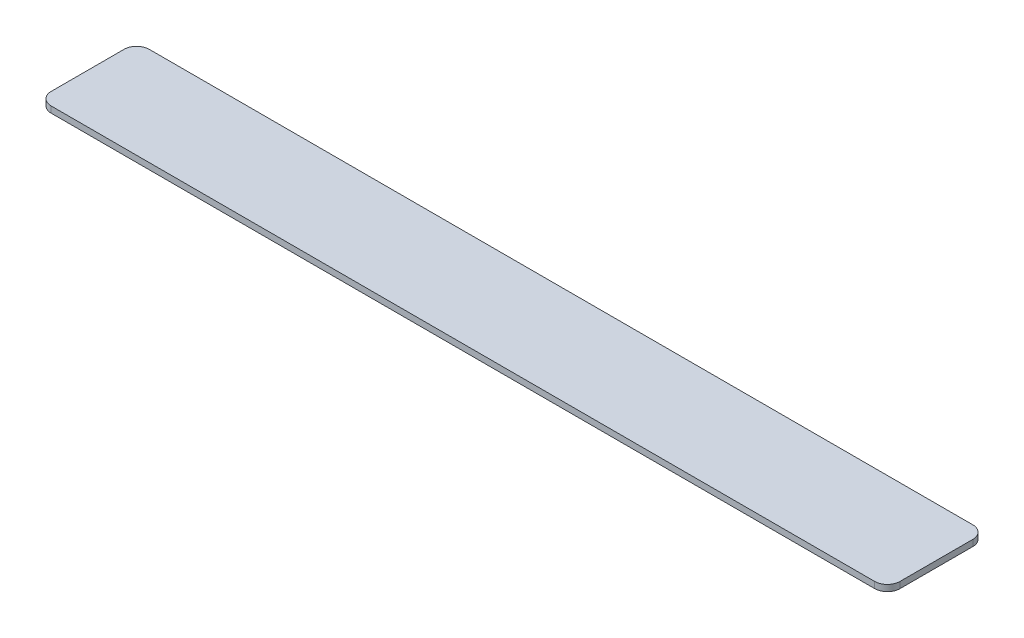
ISO-10303-21;
HEADER;
FILE_DESCRIPTION(('STEP AP214'),'2;1');
FILE_NAME('part.step','',(''),(''),'','','');
FILE_SCHEMA(('AUTOMOTIVE_DESIGN { 1 0 10303 214 1 1 1 1 }'));
ENDSEC;
DATA;
#1=APPLICATION_CONTEXT('core data for automotive mechanical design processes');
#2=APPLICATION_PROTOCOL_DEFINITION('international standard','automotive_design',2000,#1);
#3=PRODUCT_CONTEXT('',#1,'mechanical');
#4=PRODUCT('Part','Part','',(#3));
#5=PRODUCT_RELATED_PRODUCT_CATEGORY('part','',(#4));
#6=PRODUCT_DEFINITION_FORMATION('','',#4);
#7=PRODUCT_DEFINITION_CONTEXT('part definition',#1,'design');
#8=PRODUCT_DEFINITION('design','',#6,#7);
#9=PRODUCT_DEFINITION_SHAPE('','',#8);
#10=(LENGTH_UNIT() NAMED_UNIT(*) SI_UNIT(.MILLI.,.METRE.));
#11=(NAMED_UNIT(*) PLANE_ANGLE_UNIT() SI_UNIT($,.RADIAN.));
#12=(NAMED_UNIT(*) SI_UNIT($,.STERADIAN.) SOLID_ANGLE_UNIT());
#13=UNCERTAINTY_MEASURE_WITH_UNIT(LENGTH_MEASURE(1.E-05),#10,'distance_accuracy_value','');
#14=(GEOMETRIC_REPRESENTATION_CONTEXT(3) GLOBAL_UNCERTAINTY_ASSIGNED_CONTEXT((#13)) GLOBAL_UNIT_ASSIGNED_CONTEXT((#10,
#11,#12)) REPRESENTATION_CONTEXT('',''));
#15=CARTESIAN_POINT('',(0.,0.,0.));
#16=DIRECTION('',(0.,0.,1.));
#17=DIRECTION('',(1.,0.,0.));
#18=AXIS2_PLACEMENT_3D('',#15,#16,#17);
#19=CARTESIAN_POINT('',(-214.9475,3.175,-24.8412));
#20=DIRECTION('',(1.,0.,0.));
#21=DIRECTION('',(0.,0.,-1.));
#22=AXIS2_PLACEMENT_3D('',#19,#20,#21);
#23=PLANE('',#22);
#24=DIRECTION('',(0.,0.,1.));
#25=VECTOR('',#24,1.);
#26=CARTESIAN_POINT('',(-214.9475,3.175,-24.8412));
#27=LINE('',#26,#25);
#28=CARTESIAN_POINT('',(-214.9475,3.175,-18.4412));
#29=VERTEX_POINT('',#28);
#30=CARTESIAN_POINT('',(-214.9475,3.175,18.4412));
#31=VERTEX_POINT('',#30);
#32=EDGE_CURVE('E115',#29,#31,#27,.T.);
#33=ORIENTED_EDGE('',*,*,#32,.F.);
#34=DIRECTION('',(0.,-1.,0.));
#35=VECTOR('',#34,1.);
#36=CARTESIAN_POINT('',(-214.9475,3.175,-18.4412));
#37=LINE('',#36,#35);
#38=CARTESIAN_POINT('',(-214.9475,0.,-18.4412));
#39=VERTEX_POINT('',#38);
#40=EDGE_CURVE('E100',#29,#39,#37,.T.);
#41=ORIENTED_EDGE('',*,*,#40,.T.);
#42=DIRECTION('',(0.,0.,1.));
#43=VECTOR('',#42,1.);
#44=CARTESIAN_POINT('',(-214.9475,0.,-24.8412));
#45=LINE('',#44,#43);
#46=CARTESIAN_POINT('',(-214.9475,0.,18.4412));
#47=VERTEX_POINT('',#46);
#48=EDGE_CURVE('E112',#39,#47,#45,.T.);
#49=ORIENTED_EDGE('',*,*,#48,.T.);
#50=DIRECTION('',(0.,-1.,0.));
#51=VECTOR('',#50,1.);
#52=CARTESIAN_POINT('',(-214.9475,3.175,18.4412));
#53=LINE('',#52,#51);
#54=EDGE_CURVE('E117',#47,#31,#53,.F.);
#55=ORIENTED_EDGE('',*,*,#54,.T.);
#56=EDGE_LOOP('',(#33,#41,#49,#55));
#57=FACE_BOUND('',#56,.T.);
#58=ADVANCED_FACE('F31',(#57),#23,.F.);
#59=CARTESIAN_POINT('',(-214.9475,3.175,24.8412));
#60=DIRECTION('',(0.,0.,-1.));
#61=DIRECTION('',(-1.,0.,0.));
#62=AXIS2_PLACEMENT_3D('',#59,#60,#61);
#63=PLANE('',#62);
#64=DIRECTION('',(1.,0.,0.));
#65=VECTOR('',#64,1.);
#66=CARTESIAN_POINT('',(-214.9475,3.175,24.8412));
#67=LINE('',#66,#65);
#68=CARTESIAN_POINT('',(-208.5475,3.175,24.8412));
#69=VERTEX_POINT('',#68);
#70=CARTESIAN_POINT('',(208.5475,3.175,24.8412));
#71=VERTEX_POINT('',#70);
#72=EDGE_CURVE('E166',#69,#71,#67,.T.);
#73=ORIENTED_EDGE('',*,*,#72,.F.);
#74=DIRECTION('',(0.,-1.,0.));
#75=VECTOR('',#74,1.);
#76=CARTESIAN_POINT('',(-208.5475,3.175,24.8412));
#77=LINE('',#76,#75);
#78=CARTESIAN_POINT('',(-208.5475,0.,24.8412));
#79=VERTEX_POINT('',#78);
#80=EDGE_CURVE('E150',#69,#79,#77,.T.);
#81=ORIENTED_EDGE('',*,*,#80,.T.);
#82=DIRECTION('',(1.,0.,0.));
#83=VECTOR('',#82,1.);
#84=CARTESIAN_POINT('',(-214.9475,0.,24.8412));
#85=LINE('',#84,#83);
#86=CARTESIAN_POINT('',(208.5475,0.,24.8412));
#87=VERTEX_POINT('',#86);
#88=EDGE_CURVE('E121',#79,#87,#85,.T.);
#89=ORIENTED_EDGE('',*,*,#88,.T.);
#90=DIRECTION('',(0.,-1.,0.));
#91=VECTOR('',#90,1.);
#92=CARTESIAN_POINT('',(208.5475,3.175,24.8412));
#93=LINE('',#92,#91);
#94=EDGE_CURVE('E148',#87,#71,#93,.F.);
#95=ORIENTED_EDGE('',*,*,#94,.T.);
#96=EDGE_LOOP('',(#73,#81,#89,#95));
#97=FACE_BOUND('',#96,.T.);
#98=ADVANCED_FACE('F176',(#97),#63,.F.);
#99=CARTESIAN_POINT('',(214.9475,3.175,-24.8412));
#100=DIRECTION('',(-1.,0.,0.));
#101=DIRECTION('',(0.,0.,1.));
#102=AXIS2_PLACEMENT_3D('',#99,#100,#101);
#103=PLANE('',#102);
#104=DIRECTION('',(0.,0.,-1.));
#105=VECTOR('',#104,1.);
#106=CARTESIAN_POINT('',(214.9475,0.,-24.8412));
#107=LINE('',#106,#105);
#108=CARTESIAN_POINT('',(214.9475,0.,18.4412));
#109=VERTEX_POINT('',#108);
#110=CARTESIAN_POINT('',(214.9475,0.,-18.4412));
#111=VERTEX_POINT('',#110);
#112=EDGE_CURVE('E124',#109,#111,#107,.T.);
#113=ORIENTED_EDGE('',*,*,#112,.T.);
#114=DIRECTION('',(0.,-1.,0.));
#115=VECTOR('',#114,1.);
#116=CARTESIAN_POINT('',(214.9475,3.175,-18.4412));
#117=LINE('',#116,#115);
#118=CARTESIAN_POINT('',(214.9475,3.175,-18.4412));
#119=VERTEX_POINT('',#118);
#120=EDGE_CURVE('E11',#111,#119,#117,.F.);
#121=ORIENTED_EDGE('',*,*,#120,.T.);
#122=DIRECTION('',(0.,0.,-1.));
#123=VECTOR('',#122,1.);
#124=CARTESIAN_POINT('',(214.9475,3.175,-24.8412));
#125=LINE('',#124,#123);
#126=CARTESIAN_POINT('',(214.9475,3.175,18.4412));
#127=VERTEX_POINT('',#126);
#128=EDGE_CURVE('E156',#127,#119,#125,.T.);
#129=ORIENTED_EDGE('',*,*,#128,.F.);
#130=DIRECTION('',(0.,-1.,0.));
#131=VECTOR('',#130,1.);
#132=CARTESIAN_POINT('',(214.9475,3.175,18.4412));
#133=LINE('',#132,#131);
#134=EDGE_CURVE('E39',#127,#109,#133,.T.);
#135=ORIENTED_EDGE('',*,*,#134,.T.);
#136=EDGE_LOOP('',(#113,#121,#129,#135));
#137=FACE_BOUND('',#136,.T.);
#138=ADVANCED_FACE('F155',(#137),#103,.F.);
#139=CARTESIAN_POINT('',(-214.9475,3.175,-24.8412));
#140=DIRECTION('',(0.,0.,1.));
#141=DIRECTION('',(1.,0.,0.));
#142=AXIS2_PLACEMENT_3D('',#139,#140,#141);
#143=PLANE('',#142);
#144=DIRECTION('',(-1.,0.,0.));
#145=VECTOR('',#144,1.);
#146=CARTESIAN_POINT('',(-214.9475,0.,-24.8412));
#147=LINE('',#146,#145);
#148=CARTESIAN_POINT('',(208.5475,0.,-24.8412));
#149=VERTEX_POINT('',#148);
#150=CARTESIAN_POINT('',(-208.5475,0.,-24.8412));
#151=VERTEX_POINT('',#150);
#152=EDGE_CURVE('E131',#149,#151,#147,.T.);
#153=ORIENTED_EDGE('',*,*,#152,.T.);
#154=DIRECTION('',(0.,-1.,0.));
#155=VECTOR('',#154,1.);
#156=CARTESIAN_POINT('',(-208.5475,3.175,-24.8412));
#157=LINE('',#156,#155);
#158=CARTESIAN_POINT('',(-208.5475,3.175,-24.8412));
#159=VERTEX_POINT('',#158);
#160=EDGE_CURVE('E101',#151,#159,#157,.F.);
#161=ORIENTED_EDGE('',*,*,#160,.T.);
#162=DIRECTION('',(-1.,0.,0.));
#163=VECTOR('',#162,1.);
#164=CARTESIAN_POINT('',(-214.9475,3.175,-24.8412));
#165=LINE('',#164,#163);
#166=CARTESIAN_POINT('',(208.5475,3.175,-24.8412));
#167=VERTEX_POINT('',#166);
#168=EDGE_CURVE('E127',#167,#159,#165,.T.);
#169=ORIENTED_EDGE('',*,*,#168,.F.);
#170=DIRECTION('',(0.,-1.,0.));
#171=VECTOR('',#170,1.);
#172=CARTESIAN_POINT('',(208.5475,3.175,-24.8412));
#173=LINE('',#172,#171);
#174=EDGE_CURVE('E106',#167,#149,#173,.T.);
#175=ORIENTED_EDGE('',*,*,#174,.T.);
#176=EDGE_LOOP('',(#153,#161,#169,#175));
#177=FACE_BOUND('',#176,.T.);
#178=ADVANCED_FACE('F164',(#177),#143,.F.);
#179=CARTESIAN_POINT('',(-214.9475,3.175,24.8412));
#180=DIRECTION('',(0.,1.,0.));
#181=DIRECTION('',(0.,0.,1.));
#182=AXIS2_PLACEMENT_3D('',#179,#180,#181);
#183=PLANE('',#182);
#184=ORIENTED_EDGE('',*,*,#168,.T.);
#185=CARTESIAN_POINT('',(-208.5475,3.175,-18.4412));
#186=DIRECTION('',(0.,1.,0.));
#187=DIRECTION('',(0.,0.,1.));
#188=AXIS2_PLACEMENT_3D('',#185,#186,#187);
#189=CIRCLE('',#188,6.4);
#190=EDGE_CURVE('E146',#159,#29,#189,.T.);
#191=ORIENTED_EDGE('',*,*,#190,.T.);
#192=ORIENTED_EDGE('',*,*,#32,.T.);
#193=CARTESIAN_POINT('',(-208.5475,3.175,18.4412));
#194=DIRECTION('',(0.,1.,0.));
#195=DIRECTION('',(0.,0.,1.));
#196=AXIS2_PLACEMENT_3D('',#193,#194,#195);
#197=CIRCLE('',#196,6.4);
#198=EDGE_CURVE('E144',#31,#69,#197,.T.);
#199=ORIENTED_EDGE('',*,*,#198,.T.);
#200=ORIENTED_EDGE('',*,*,#72,.T.);
#201=CARTESIAN_POINT('',(208.5475,3.175,18.4412));
#202=DIRECTION('',(0.,1.,0.));
#203=DIRECTION('',(0.,0.,1.));
#204=AXIS2_PLACEMENT_3D('',#201,#202,#203);
#205=CIRCLE('',#204,6.4);
#206=EDGE_CURVE('E51',#71,#127,#205,.T.);
#207=ORIENTED_EDGE('',*,*,#206,.T.);
#208=ORIENTED_EDGE('',*,*,#128,.T.);
#209=CARTESIAN_POINT('',(208.5475,3.175,-18.4412));
#210=DIRECTION('',(0.,1.,0.));
#211=DIRECTION('',(0.,0.,1.));
#212=AXIS2_PLACEMENT_3D('',#209,#210,#211);
#213=CIRCLE('',#212,6.4);
#214=EDGE_CURVE('E142',#119,#167,#213,.T.);
#215=ORIENTED_EDGE('',*,*,#214,.T.);
#216=EDGE_LOOP('',(#184,#191,#192,#199,#200,#207,#208,#215));
#217=FACE_BOUND('',#216,.T.);
#218=ADVANCED_FACE('F170',(#217),#183,.T.);
#219=CARTESIAN_POINT('',(-214.9475,0.,24.8412));
#220=DIRECTION('',(0.,1.,0.));
#221=DIRECTION('',(0.,0.,1.));
#222=AXIS2_PLACEMENT_3D('',#219,#220,#221);
#223=PLANE('',#222);
#224=ORIENTED_EDGE('',*,*,#48,.F.);
#225=CARTESIAN_POINT('',(-208.5475,0.,-18.4412));
#226=DIRECTION('',(0.,1.,0.));
#227=DIRECTION('',(0.,0.,1.));
#228=AXIS2_PLACEMENT_3D('',#225,#226,#227);
#229=CIRCLE('',#228,6.4);
#230=EDGE_CURVE('E96',#39,#151,#229,.F.);
#231=ORIENTED_EDGE('',*,*,#230,.T.);
#232=ORIENTED_EDGE('',*,*,#152,.F.);
#233=CARTESIAN_POINT('',(208.5475,0.,-18.4412));
#234=DIRECTION('',(0.,1.,0.));
#235=DIRECTION('',(0.,0.,1.));
#236=AXIS2_PLACEMENT_3D('',#233,#234,#235);
#237=CIRCLE('',#236,6.4);
#238=EDGE_CURVE('E135',#149,#111,#237,.F.);
#239=ORIENTED_EDGE('',*,*,#238,.T.);
#240=ORIENTED_EDGE('',*,*,#112,.F.);
#241=CARTESIAN_POINT('',(208.5475,0.,18.4412));
#242=DIRECTION('',(0.,1.,0.));
#243=DIRECTION('',(0.,0.,1.));
#244=AXIS2_PLACEMENT_3D('',#241,#242,#243);
#245=CIRCLE('',#244,6.4);
#246=EDGE_CURVE('E116',#109,#87,#245,.F.);
#247=ORIENTED_EDGE('',*,*,#246,.T.);
#248=ORIENTED_EDGE('',*,*,#88,.F.);
#249=CARTESIAN_POINT('',(-208.5475,0.,18.4412));
#250=DIRECTION('',(0.,1.,0.));
#251=DIRECTION('',(0.,0.,1.));
#252=AXIS2_PLACEMENT_3D('',#249,#250,#251);
#253=CIRCLE('',#252,6.4);
#254=EDGE_CURVE('E107',#79,#47,#253,.F.);
#255=ORIENTED_EDGE('',*,*,#254,.T.);
#256=EDGE_LOOP('',(#224,#231,#232,#239,#240,#247,#248,#255));
#257=FACE_BOUND('',#256,.T.);
#258=ADVANCED_FACE('F119',(#257),#223,.F.);
#259=CARTESIAN_POINT('',(-208.5475,3.175,-18.4412));
#260=DIRECTION('',(0.,-1.,0.));
#261=DIRECTION('',(0.,0.,-1.));
#262=AXIS2_PLACEMENT_3D('',#259,#260,#261);
#263=CYLINDRICAL_SURFACE('',#262,6.4);
#264=ORIENTED_EDGE('',*,*,#190,.F.);
#265=ORIENTED_EDGE('',*,*,#160,.F.);
#266=ORIENTED_EDGE('',*,*,#230,.F.);
#267=ORIENTED_EDGE('',*,*,#40,.F.);
#268=EDGE_LOOP('',(#264,#265,#266,#267));
#269=FACE_BOUND('',#268,.T.);
#270=ADVANCED_FACE('F99',(#269),#263,.T.);
#271=CARTESIAN_POINT('',(-208.5475,3.175,18.4412));
#272=DIRECTION('',(0.,-1.,0.));
#273=DIRECTION('',(0.,0.,-1.));
#274=AXIS2_PLACEMENT_3D('',#271,#272,#273);
#275=CYLINDRICAL_SURFACE('',#274,6.4);
#276=ORIENTED_EDGE('',*,*,#198,.F.);
#277=ORIENTED_EDGE('',*,*,#54,.F.);
#278=ORIENTED_EDGE('',*,*,#254,.F.);
#279=ORIENTED_EDGE('',*,*,#80,.F.);
#280=EDGE_LOOP('',(#276,#277,#278,#279));
#281=FACE_BOUND('',#280,.T.);
#282=ADVANCED_FACE('F174',(#281),#275,.T.);
#283=CARTESIAN_POINT('',(208.5475,3.175,-18.4412));
#284=DIRECTION('',(0.,-1.,0.));
#285=DIRECTION('',(0.,0.,-1.));
#286=AXIS2_PLACEMENT_3D('',#283,#284,#285);
#287=CYLINDRICAL_SURFACE('',#286,6.4);
#288=ORIENTED_EDGE('',*,*,#214,.F.);
#289=ORIENTED_EDGE('',*,*,#120,.F.);
#290=ORIENTED_EDGE('',*,*,#238,.F.);
#291=ORIENTED_EDGE('',*,*,#174,.F.);
#292=EDGE_LOOP('',(#288,#289,#290,#291));
#293=FACE_BOUND('',#292,.T.);
#294=ADVANCED_FACE('F161',(#293),#287,.T.);
#295=CARTESIAN_POINT('',(208.5475,3.175,18.4412));
#296=DIRECTION('',(0.,-1.,0.));
#297=DIRECTION('',(0.,0.,-1.));
#298=AXIS2_PLACEMENT_3D('',#295,#296,#297);
#299=CYLINDRICAL_SURFACE('',#298,6.4);
#300=ORIENTED_EDGE('',*,*,#206,.F.);
#301=ORIENTED_EDGE('',*,*,#94,.F.);
#302=ORIENTED_EDGE('',*,*,#246,.F.);
#303=ORIENTED_EDGE('',*,*,#134,.F.);
#304=EDGE_LOOP('',(#300,#301,#302,#303));
#305=FACE_BOUND('',#304,.T.);
#306=ADVANCED_FACE('F33',(#305),#299,.T.);
#307=CLOSED_SHELL('',(#58,#98,#138,#178,#218,#258,#270,#282,#294,#306));
#308=MANIFOLD_SOLID_BREP('B2',#307);
#309=ADVANCED_BREP_SHAPE_REPRESENTATION('',(#18,#308),#14);
#310=SHAPE_DEFINITION_REPRESENTATION(#9,#309);
ENDSEC;
END-ISO-10303-21;
